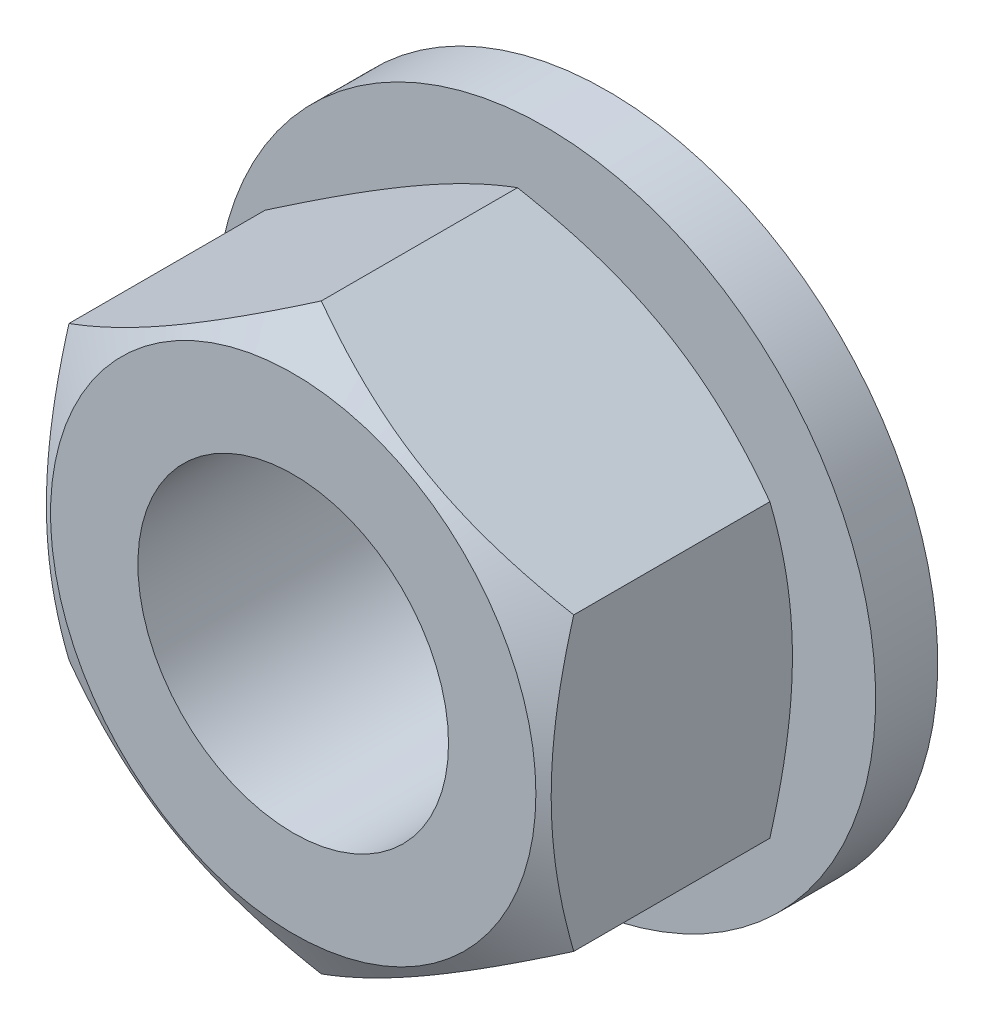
ISO-10303-21;
HEADER;
FILE_DESCRIPTION(('STEP AP214'),'2;1');
FILE_NAME('part.step','',(''),(''),'','','');
FILE_SCHEMA(('AUTOMOTIVE_DESIGN { 1 0 10303 214 1 1 1 1 }'));
ENDSEC;
DATA;
#1=APPLICATION_CONTEXT('core data for automotive mechanical design processes');
#2=APPLICATION_PROTOCOL_DEFINITION('international standard','automotive_design',2000,#1);
#3=PRODUCT_CONTEXT('',#1,'mechanical');
#4=PRODUCT('Part','Part','',(#3));
#5=PRODUCT_RELATED_PRODUCT_CATEGORY('part','',(#4));
#6=PRODUCT_DEFINITION_FORMATION('','',#4);
#7=PRODUCT_DEFINITION_CONTEXT('part definition',#1,'design');
#8=PRODUCT_DEFINITION('design','',#6,#7);
#9=PRODUCT_DEFINITION_SHAPE('','',#8);
#10=(LENGTH_UNIT() NAMED_UNIT(*) SI_UNIT(.MILLI.,.METRE.));
#11=(NAMED_UNIT(*) PLANE_ANGLE_UNIT() SI_UNIT($,.RADIAN.));
#12=(NAMED_UNIT(*) SI_UNIT($,.STERADIAN.) SOLID_ANGLE_UNIT());
#13=UNCERTAINTY_MEASURE_WITH_UNIT(LENGTH_MEASURE(1.E-05),#10,'distance_accuracy_value','');
#14=(GEOMETRIC_REPRESENTATION_CONTEXT(3) GLOBAL_UNCERTAINTY_ASSIGNED_CONTEXT((#13)) GLOBAL_UNIT_ASSIGNED_CONTEXT((#10,
#11,#12)) REPRESENTATION_CONTEXT('',''));
#15=CARTESIAN_POINT('',(0.,0.,0.));
#16=DIRECTION('',(0.,0.,1.));
#17=DIRECTION('',(1.,0.,0.));
#18=AXIS2_PLACEMENT_3D('',#15,#16,#17);
#19=CARTESIAN_POINT('',(-6.5,-3.75277674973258,8.1));
#20=DIRECTION('',(-1.,0.,0.));
#21=DIRECTION('',(0.,0.,1.));
#22=AXIS2_PLACEMENT_3D('',#19,#20,#21);
#23=PLANE('',#22);
#24=DIRECTION('',(0.,0.,-1.));
#25=VECTOR('',#24,1.);
#26=CARTESIAN_POINT('',(-6.5,-3.75277674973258,8.1));
#27=LINE('',#26,#25);
#28=CARTESIAN_POINT('',(-6.5,-3.75277674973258,7.37510584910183));
#29=VERTEX_POINT('',#28);
#30=CARTESIAN_POINT('',(-6.5,-3.75277674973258,2.32489415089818));
#31=VERTEX_POINT('',#30);
#32=EDGE_CURVE('E9',#29,#31,#27,.T.);
#33=ORIENTED_EDGE('',*,*,#32,.F.);
#34=CARTESIAN_POINT('',(-6.5,-10.0376561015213,4.80422452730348));
#35=CARTESIAN_POINT('',(-6.5,-9.75411250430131,4.94159609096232));
#36=CARTESIAN_POINT('',(-6.5,-9.46991338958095,5.077638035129));
#37=CARTESIAN_POINT('',(-6.5,-8.89985536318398,5.34631399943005));
#38=CARTESIAN_POINT('',(-6.5,-8.61399619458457,5.47894747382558));
#39=CARTESIAN_POINT('',(-6.5,-8.03877585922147,5.74073425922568));
#40=CARTESIAN_POINT('',(-6.5,-7.74940407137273,5.86986431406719));
#41=CARTESIAN_POINT('',(-6.5,-7.16834386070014,6.12278244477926));
#42=CARTESIAN_POINT('',(-6.5,-6.87665554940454,6.24657077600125));
#43=CARTESIAN_POINT('',(-6.5,-6.28125325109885,6.49119214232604));
#44=CARTESIAN_POINT('',(-6.5,-5.97744998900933,6.61180907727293));
#45=CARTESIAN_POINT('',(-6.5,-5.36627311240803,6.84381010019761));
#46=CARTESIAN_POINT('',(-6.5,-5.05889909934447,6.95519314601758));
#47=CARTESIAN_POINT('',(-6.5,-4.44068218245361,7.16577134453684));
#48=CARTESIAN_POINT('',(-6.5,-4.12984789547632,7.26499154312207));
#49=CARTESIAN_POINT('',(-6.5,-3.50371775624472,7.44803088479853));
#50=CARTESIAN_POINT('',(-6.5,-3.18842335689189,7.53185492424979));
#51=CARTESIAN_POINT('',(-6.5,-2.55494944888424,7.67961205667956));
#52=CARTESIAN_POINT('',(-6.5,-2.2367951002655,7.74365127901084));
#53=CARTESIAN_POINT('',(-6.5,-1.59653036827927,7.84817364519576));
#54=CARTESIAN_POINT('',(-6.5,-1.27442034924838,7.8886589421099));
#55=CARTESIAN_POINT('',(-6.5,-0.791708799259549,7.9290321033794));
#56=CARTESIAN_POINT('',(-6.5,-0.631917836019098,7.93909642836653));
#57=CARTESIAN_POINT('',(-6.5,-0.312046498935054,7.95246757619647));
#58=CARTESIAN_POINT('',(-6.5,-0.1519661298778,7.95577450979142));
#59=CARTESIAN_POINT('',(-6.5,0.168189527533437,7.95554451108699));
#60=CARTESIAN_POINT('',(-6.5,0.328264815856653,7.95200754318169));
#61=CARTESIAN_POINT('',(-6.5,0.648125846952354,7.93817746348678));
#62=CARTESIAN_POINT('',(-6.5,0.807911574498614,7.92788400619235));
#63=CARTESIAN_POINT('',(-6.5,1.19322981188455,7.89513066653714));
#64=CARTESIAN_POINT('',(-6.5,1.41848933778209,7.86939241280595));
#65=CARTESIAN_POINT('',(-6.5,1.86729775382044,7.80590134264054));
#66=CARTESIAN_POINT('',(-6.5,2.09084640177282,7.76814685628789));
#67=CARTESIAN_POINT('',(-6.5,2.75869205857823,7.6388642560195));
#68=CARTESIAN_POINT('',(-6.5,3.19993162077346,7.53134171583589));
#69=CARTESIAN_POINT('',(-6.5,3.85964942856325,7.3453762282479));
#70=CARTESIAN_POINT('',(-6.5,4.08156176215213,7.27841935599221));
#71=CARTESIAN_POINT('',(-6.5,4.52323021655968,7.13767302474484));
#72=CARTESIAN_POINT('',(-6.5,4.74298632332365,7.06388352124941));
#73=CARTESIAN_POINT('',(-6.5,5.18041384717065,6.91064572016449));
#74=CARTESIAN_POINT('',(-6.5,5.39808595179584,6.83119936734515));
#75=CARTESIAN_POINT('',(-6.5,5.83163487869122,6.66757047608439));
#76=CARTESIAN_POINT('',(-6.5,6.04751172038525,6.58338798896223));
#77=CARTESIAN_POINT('',(-6.5,6.55037775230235,6.38195062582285));
#78=CARTESIAN_POINT('',(-6.5,6.8367403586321,6.26313460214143));
#79=CARTESIAN_POINT('',(-6.5,7.40708826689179,6.01991162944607));
#80=CARTESIAN_POINT('',(-6.5,7.69107343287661,5.8955043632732));
#81=CARTESIAN_POINT('',(-6.5,8.25709520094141,5.64220339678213));
#82=CARTESIAN_POINT('',(-6.5,8.53913142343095,5.51330885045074));
#83=CARTESIAN_POINT('',(-6.5,9.10153191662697,5.2519160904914));
#84=CARTESIAN_POINT('',(-6.5,9.38189615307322,5.11941780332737));
#85=CARTESIAN_POINT('',(-6.5,9.94150180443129,4.85134949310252));
#86=CARTESIAN_POINT('',(-6.5,10.2207417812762,4.71577647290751));
#87=CARTESIAN_POINT('',(-6.5,10.7780317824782,4.44220418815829));
#88=CARTESIAN_POINT('',(-6.5,11.0560817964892,4.30420490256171));
#89=CARTESIAN_POINT('',(-6.5,11.8886573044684,3.88723826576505));
#90=CARTESIAN_POINT('',(-6.5,12.4416787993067,3.60526807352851));
#91=CARTESIAN_POINT('',(-6.5,13.4996337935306,3.0589862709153));
#92=CARTESIAN_POINT('',(-6.5,14.0047976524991,2.7951188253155));
#93=CARTESIAN_POINT('',(-6.5,15.0132440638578,2.2637753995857));
#94=CARTESIAN_POINT('',(-6.5,15.5165265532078,1.99629929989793));
#95=CARTESIAN_POINT('',(-6.5,16.5204177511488,1.45923474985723));
#96=CARTESIAN_POINT('',(-6.5,17.0210299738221,1.18965285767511));
#97=CARTESIAN_POINT('',(-6.5,18.0210477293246,0.648322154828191));
#98=CARTESIAN_POINT('',(-6.5,18.5204533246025,0.376573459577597));
#99=CARTESIAN_POINT('',(-6.5,19.0194129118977,0.104013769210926));
#100=B_SPLINE_CURVE_WITH_KNOTS('',3,(#34,#35,#36,#37,#38,#39,#40,#41,#42,#43,#44,#45,#46,#47,
#48,#49,#50,#51,#52,#53,#54,#55,#56,#57,#58,#59,#60,#61,#62,#63,#64,#65,#66,#67,#68,#69,#70,#71,
#72,#73,#74,#75,#76,#77,#78,#79,#80,#81,#82,#83,#84,#85,#86,#87,#88,#89,#90,#91,#92,#93,#94,#95,
#96,#97,#98,#99),.UNSPECIFIED.,.F.,.F.,(4,2,2,2,2,2,2,2,2,2,2,2,2,2,2,2,2,2,2,2,2,2,2,2,2,2,2,2,
2,2,2,2,4),(0.,0.945216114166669,1.89058263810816,2.84116840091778,3.7917086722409,
4.77220681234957,5.75281546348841,6.73136964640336,7.70961208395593,8.68251209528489,
9.65532316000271,10.1355247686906,10.615718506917,11.0959147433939,11.5761355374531,
12.2559262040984,12.9358113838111,14.296353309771,14.9916778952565,15.6870070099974,
16.3820982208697,17.0771819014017,18.0072031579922,18.9372772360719,19.867527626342,
20.7977970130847,21.7290158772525,22.6602428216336,24.5224617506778,26.2322265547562,
27.942048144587,29.647792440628,31.3534464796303),.UNSPECIFIED.);
#101=CARTESIAN_POINT('',(-6.5,3.75277674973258,7.37510584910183));
#102=VERTEX_POINT('',#101);
#103=EDGE_CURVE('E69',#29,#102,#100,.T.);
#104=ORIENTED_EDGE('',*,*,#103,.T.);
#105=DIRECTION('',(0.,0.,-1.));
#106=VECTOR('',#105,1.);
#107=CARTESIAN_POINT('',(-6.5,3.75277674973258,8.1));
#108=LINE('',#107,#106);
#109=CARTESIAN_POINT('',(-6.5,3.75277674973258,2.32489415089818));
#110=VERTEX_POINT('',#109);
#111=EDGE_CURVE('E38',#102,#110,#108,.T.);
#112=ORIENTED_EDGE('',*,*,#111,.T.);
#113=CARTESIAN_POINT('',(-6.5,-10.0118859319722,4.8832916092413));
#114=CARTESIAN_POINT('',(-6.5,-9.72855336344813,4.74612691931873));
#115=CARTESIAN_POINT('',(-6.5,-9.44456295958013,4.61029742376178));
#116=CARTESIAN_POINT('',(-6.5,-8.87491638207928,4.34206118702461));
#117=CARTESIAN_POINT('',(-6.5,-8.58925994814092,4.20965499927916));
#118=CARTESIAN_POINT('',(-6.5,-8.01442627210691,3.94833687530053));
#119=CARTESIAN_POINT('',(-6.5,-7.72523828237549,3.81944849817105));
#120=CARTESIAN_POINT('',(-6.5,-7.14453800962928,3.56703882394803));
#121=CARTESIAN_POINT('',(-6.5,-6.85302583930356,3.44351726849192));
#122=CARTESIAN_POINT('',(-6.5,-6.25807741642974,3.19951345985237));
#123=CARTESIAN_POINT('',(-6.5,-5.95455264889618,3.07924583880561));
#124=CARTESIAN_POINT('',(-6.5,-5.34392655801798,2.84798011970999));
#125=CARTESIAN_POINT('',(-6.5,-5.03682483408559,2.73698307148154));
#126=CARTESIAN_POINT('',(-6.5,-4.41915477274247,2.52722237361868));
#127=CARTESIAN_POINT('',(-6.5,-4.10859513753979,2.42843335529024));
#128=CARTESIAN_POINT('',(-6.5,-3.48301880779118,2.24630497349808));
#129=CARTESIAN_POINT('',(-6.5,-3.16800357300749,2.16296067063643));
#130=CARTESIAN_POINT('',(-6.5,-2.53508513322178,2.0162010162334));
#131=CARTESIAN_POINT('',(-6.5,-2.21720674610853,1.9526803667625));
#132=CARTESIAN_POINT('',(-6.5,-1.577525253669,1.84922188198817));
#133=CARTESIAN_POINT('',(-6.5,-1.2557225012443,1.80928194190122));
#134=CARTESIAN_POINT('',(-6.5,-0.773490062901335,1.76971130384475));
#135=CARTESIAN_POINT('',(-6.5,-0.613854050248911,1.75991023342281));
#136=CARTESIAN_POINT('',(-6.5,-0.294303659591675,1.74705683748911));
#137=CARTESIAN_POINT('',(-6.5,-0.134389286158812,1.74400440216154));
#138=CARTESIAN_POINT('',(-6.5,0.18542391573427,1.7447285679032));
#139=CARTESIAN_POINT('',(-6.5,0.345322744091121,1.7485052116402));
#140=CARTESIAN_POINT('',(-6.5,0.664821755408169,1.76279442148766));
#141=CARTESIAN_POINT('',(-6.5,0.824421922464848,1.77330733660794));
#142=CARTESIAN_POINT('',(-6.5,1.21009106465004,1.80663121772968));
#143=CARTESIAN_POINT('',(-6.5,1.43587954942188,1.8327551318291));
#144=CARTESIAN_POINT('',(-6.5,1.88572477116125,1.89704439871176));
#145=CARTESIAN_POINT('',(-6.5,2.10978125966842,1.93521144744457));
#146=CARTESIAN_POINT('',(-6.5,2.77912789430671,2.06574869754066));
#147=CARTESIAN_POINT('',(-6.5,3.22133379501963,2.17412948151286));
#148=CARTESIAN_POINT('',(-6.5,3.88246330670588,2.36136414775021));
#149=CARTESIAN_POINT('',(-6.5,4.10483365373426,2.42874144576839));
#150=CARTESIAN_POINT('',(-6.5,4.54741339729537,2.5703175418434));
#151=CARTESIAN_POINT('',(-6.5,4.76762277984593,2.64451638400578));
#152=CARTESIAN_POINT('',(-6.5,5.20595333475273,2.79855980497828));
#153=CARTESIAN_POINT('',(-6.5,5.42407520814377,2.87840240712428));
#154=CARTESIAN_POINT('',(-6.5,5.85852369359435,3.0428115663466));
#155=CARTESIAN_POINT('',(-6.5,6.07485032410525,3.1273780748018));
#156=CARTESIAN_POINT('',(-6.5,6.57455675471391,3.3280091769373));
#157=CARTESIAN_POINT('',(-6.5,6.85735139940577,3.44552826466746));
#158=CARTESIAN_POINT('',(-6.5,7.42062861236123,3.68599704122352));
#159=CARTESIAN_POINT('',(-6.5,7.70111105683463,3.80894701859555));
#160=CARTESIAN_POINT('',(-6.5,8.26017575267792,4.05921670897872));
#161=CARTESIAN_POINT('',(-6.5,8.53875764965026,4.18653721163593));
#162=CARTESIAN_POINT('',(-6.5,9.09428863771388,4.44469787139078));
#163=CARTESIAN_POINT('',(-6.5,9.3712376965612,4.57553809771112));
#164=CARTESIAN_POINT('',(-6.5,9.92401115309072,4.84021331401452));
#165=CARTESIAN_POINT('',(-6.5,10.1998342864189,4.97405094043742));
#166=CARTESIAN_POINT('',(-6.5,10.750313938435,5.24410623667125));
#167=CARTESIAN_POINT('',(-6.5,11.0249704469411,5.38032392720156));
#168=CARTESIAN_POINT('',(-6.5,11.8474745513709,5.79193510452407));
#169=CARTESIAN_POINT('',(-6.5,12.3938452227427,6.07028114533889));
#170=CARTESIAN_POINT('',(-6.5,13.189271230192,6.48066012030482));
#171=CARTESIAN_POINT('',(-6.5,13.4394696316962,6.61049135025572));
#172=CARTESIAN_POINT('',(-6.5,13.9393233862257,6.87118553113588));
#173=CARTESIAN_POINT('',(-6.5,14.1889787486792,7.00204846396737));
#174=CARTESIAN_POINT('',(-6.5,14.9372586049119,7.39598704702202));
#175=CARTESIAN_POINT('',(-6.5,15.4351776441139,7.6604025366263));
#176=CARTESIAN_POINT('',(-6.5,16.4283993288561,8.19135046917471));
#177=CARTESIAN_POINT('',(-6.5,16.9237053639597,8.45787658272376));
#178=CARTESIAN_POINT('',(-6.5,17.9131191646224,8.9930841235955));
#179=CARTESIAN_POINT('',(-6.5,18.4072269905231,9.26176543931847));
#180=CARTESIAN_POINT('',(-6.5,18.9008904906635,9.53125551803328));
#181=B_SPLINE_CURVE_WITH_KNOTS('',3,(#113,#114,#115,#116,#117,#118,#119,#120,#121,#122,#123,
#124,#125,#126,#127,#128,#129,#130,#131,#132,#133,#134,#135,#136,#137,#138,#139,#140,#141,#142,
#143,#144,#145,#146,#147,#148,#149,#150,#151,#152,#153,#154,#155,#156,#157,#158,#159,#160,#161,
#162,#163,#164,#165,#166,#167,#168,#169,#170,#171,#172,#173,#174,#175,#176,#177,#178,#179,#180),
.UNSPECIFIED.,.F.,.F.,(4,2,2,2,2,2,2,2,2,2,2,2,2,2,2,2,2,2,2,2,2,2,2,2,2,2,2,2,2,2,2,2,2,4),(0.,
0.944375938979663,1.88890360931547,2.83869006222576,3.78843074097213,4.76776487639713,
5.74720976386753,6.72458382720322,7.7016447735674,8.67342384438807,9.64511616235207,
10.1248049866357,10.6044860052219,11.0841700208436,11.5638788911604,12.2453767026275,
12.9269705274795,14.2909426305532,14.9879481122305,15.6849581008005,16.3817251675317,
17.0784850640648,17.9971327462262,18.9158292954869,19.8346927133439,20.753574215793,
21.6732984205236,22.5930306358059,24.4325333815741,25.2781675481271,26.1237869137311,
27.8150905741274,29.5024730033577,31.1897686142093),.UNSPECIFIED.);
#182=EDGE_CURVE('E89',#31,#110,#181,.T.);
#183=ORIENTED_EDGE('',*,*,#182,.F.);
#184=EDGE_LOOP('',(#33,#104,#112,#183));
#185=FACE_BOUND('',#184,.T.);
#186=ADVANCED_FACE('F14',(#185),#23,.T.);
#187=CARTESIAN_POINT('',(-6.5,-3.75277674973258,8.1));
#188=DIRECTION('',(0.5,0.866025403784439,0.));
#189=DIRECTION('',(-0.866025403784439,0.5,0.));
#190=AXIS2_PLACEMENT_3D('',#187,#188,#189);
#191=PLANE('',#190);
#192=CARTESIAN_POINT('',(-6.5002,-3.75266127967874,7.37503918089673));
#193=CARTESIAN_POINT('',(-6.35732254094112,-3.83515161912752,7.42265800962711));
#194=CARTESIAN_POINT('',(-6.21391236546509,-3.91794952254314,7.46811573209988));
#195=CARTESIAN_POINT('',(-5.9259273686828,-4.08421773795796,7.55411375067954));
#196=CARTESIAN_POINT('',(-5.78135207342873,-4.16768832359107,7.59465192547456));
#197=CARTESIAN_POINT('',(-5.34531134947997,-4.41943655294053,7.70809143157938));
#198=CARTESIAN_POINT('',(-5.05212471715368,-4.58870793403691,7.77261462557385));
#199=CARTESIAN_POINT('',(-4.61337625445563,-4.84201947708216,7.8482758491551));
#200=CARTESIAN_POINT('',(-4.46912536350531,-4.92530276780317,7.8698295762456));
#201=CARTESIAN_POINT('',(-4.17997178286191,-5.09224566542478,7.90597211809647));
#202=CARTESIAN_POINT('',(-4.03506915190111,-5.17590523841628,7.92056154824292));
#203=CARTESIAN_POINT('',(-3.74501222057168,-5.34336968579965,7.94240368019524));
#204=CARTESIAN_POINT('',(-3.59985839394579,-5.42717428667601,7.94966470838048));
#205=CARTESIAN_POINT('',(-3.30942466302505,-5.59485627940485,7.95670213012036));
#206=CARTESIAN_POINT('',(-3.16414476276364,-5.67873366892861,7.95647875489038));
#207=CARTESIAN_POINT('',(-2.76612405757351,-5.90853103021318,7.94557897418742));
#208=CARTESIAN_POINT('',(-2.51351353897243,-6.05437578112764,7.92728061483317));
#209=CARTESIAN_POINT('',(-2.00997032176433,-6.34509659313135,7.86925609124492));
#210=CARTESIAN_POINT('',(-1.75903939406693,-6.48997163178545,7.82951009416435));
#211=CARTESIAN_POINT('',(-1.25448277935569,-6.78127752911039,7.73015652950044));
#212=CARTESIAN_POINT('',(-1.0009207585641,-6.92767163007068,7.67012800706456));
#213=CARTESIAN_POINT('',(-0.497578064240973,-7.21827667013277,7.53388744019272));
#214=CARTESIAN_POINT('',(-0.247790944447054,-7.36249133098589,7.457707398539));
#215=CARTESIAN_POINT('',(0.000199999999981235,-7.50566896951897,7.37503918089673));
#216=B_SPLINE_CURVE_WITH_KNOTS('',3,(#192,#193,#194,#195,#196,#197,#198,#199,#200,#201,#202,
#203,#204,#205,#206,#207,#208,#209,#210,#211,#212,#213,#214,#215),.UNSPECIFIED.,.F.,.F.,(4,2,2,
2,2,2,2,2,2,2,2,4),(0.,0.515105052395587,1.03043143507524,2.06322554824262,2.56697389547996,
3.07067772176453,3.57380860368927,4.07692394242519,4.95279354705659,5.82947446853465,
6.72559912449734,7.61996451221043),.UNSPECIFIED.);
#217=CARTESIAN_POINT('',(0.,-7.50555349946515,7.37510584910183));
#218=VERTEX_POINT('',#217);
#219=EDGE_CURVE('E77',#29,#218,#216,.T.);
#220=ORIENTED_EDGE('',*,*,#219,.F.);
#221=ORIENTED_EDGE('',*,*,#32,.T.);
#222=CARTESIAN_POINT('',(-6.5002,-3.75266127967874,2.32496081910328));
#223=CARTESIAN_POINT('',(-6.35732254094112,-3.83515161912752,2.2773419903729));
#224=CARTESIAN_POINT('',(-6.21391236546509,-3.91794952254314,2.23188426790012));
#225=CARTESIAN_POINT('',(-5.9259273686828,-4.08421773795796,2.14588624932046));
#226=CARTESIAN_POINT('',(-5.78135207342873,-4.16768832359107,2.10534807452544));
#227=CARTESIAN_POINT('',(-5.34531134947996,-4.41943655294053,1.99190856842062));
#228=CARTESIAN_POINT('',(-5.05212471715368,-4.58870793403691,1.92738537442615));
#229=CARTESIAN_POINT('',(-4.61337625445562,-4.84201947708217,1.8517241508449));
#230=CARTESIAN_POINT('',(-4.4691253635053,-4.92530276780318,1.8301704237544));
#231=CARTESIAN_POINT('',(-4.1799717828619,-5.09224566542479,1.79402788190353));
#232=CARTESIAN_POINT('',(-4.0350691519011,-5.17590523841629,1.77943845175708));
#233=CARTESIAN_POINT('',(-3.74501222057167,-5.34336968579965,1.75759631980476));
#234=CARTESIAN_POINT('',(-3.59985839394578,-5.42717428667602,1.75033529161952));
#235=CARTESIAN_POINT('',(-3.30942466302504,-5.59485627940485,1.74329786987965));
#236=CARTESIAN_POINT('',(-3.16414476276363,-5.67873366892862,1.74352124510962));
#237=CARTESIAN_POINT('',(-2.7661240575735,-5.90853103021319,1.75442102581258));
#238=CARTESIAN_POINT('',(-2.51351353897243,-6.05437578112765,1.77271938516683));
#239=CARTESIAN_POINT('',(-2.00997032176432,-6.34509659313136,1.83074390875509));
#240=CARTESIAN_POINT('',(-1.75903939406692,-6.48997163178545,1.87048990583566));
#241=CARTESIAN_POINT('',(-1.25448277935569,-6.78127752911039,1.96984347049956));
#242=CARTESIAN_POINT('',(-1.0009207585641,-6.92767163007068,2.02987199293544));
#243=CARTESIAN_POINT('',(-0.497578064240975,-7.21827667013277,2.16611255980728));
#244=CARTESIAN_POINT('',(-0.247790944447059,-7.36249133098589,2.242292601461));
#245=CARTESIAN_POINT('',(0.000199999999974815,-7.50566896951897,2.32496081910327));
#246=B_SPLINE_CURVE_WITH_KNOTS('',3,(#222,#223,#224,#225,#226,#227,#228,#229,#230,#231,#232,
#233,#234,#235,#236,#237,#238,#239,#240,#241,#242,#243,#244,#245),.UNSPECIFIED.,.F.,.F.,(4,2,2,
2,2,2,2,2,2,2,2,4),(0.,0.515105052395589,1.03043143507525,2.06322554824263,2.56697389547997,
3.07067772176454,3.57380860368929,4.07692394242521,4.9527935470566,5.82947446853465,
6.72559912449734,7.61996451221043),.UNSPECIFIED.);
#247=CARTESIAN_POINT('',(0.,-7.50555349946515,2.32489415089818));
#248=VERTEX_POINT('',#247);
#249=EDGE_CURVE('E111',#31,#248,#246,.T.);
#250=ORIENTED_EDGE('',*,*,#249,.T.);
#251=DIRECTION('',(0.,0.,-1.));
#252=VECTOR('',#251,1.);
#253=CARTESIAN_POINT('',(0.,-7.50555349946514,8.1));
#254=LINE('',#253,#252);
#255=EDGE_CURVE('E23',#218,#248,#254,.T.);
#256=ORIENTED_EDGE('',*,*,#255,.F.);
#257=EDGE_LOOP('',(#220,#221,#250,#256));
#258=FACE_BOUND('',#257,.T.);
#259=ADVANCED_FACE('F16',(#258),#191,.F.);
#260=CARTESIAN_POINT('',(6.5,-3.75277674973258,8.1));
#261=DIRECTION('',(0.5,-0.86602540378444,0.));
#262=DIRECTION('',(0.86602540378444,0.5,0.));
#263=AXIS2_PLACEMENT_3D('',#260,#261,#262);
#264=PLANE('',#263);
#265=DIRECTION('',(0.,0.,-1.));
#266=VECTOR('',#265,1.);
#267=CARTESIAN_POINT('',(6.5,-3.75277674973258,8.1));
#268=LINE('',#267,#266);
#269=CARTESIAN_POINT('',(6.5,-3.75277674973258,7.37510584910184));
#270=VERTEX_POINT('',#269);
#271=CARTESIAN_POINT('',(6.5,-3.75277674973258,2.32489415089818));
#272=VERTEX_POINT('',#271);
#273=EDGE_CURVE('E94',#270,#272,#268,.T.);
#274=ORIENTED_EDGE('',*,*,#273,.F.);
#275=CARTESIAN_POINT('',(6.5002,-3.75266127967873,7.37503918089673));
#276=CARTESIAN_POINT('',(6.35732254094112,-3.83515161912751,7.42265800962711));
#277=CARTESIAN_POINT('',(6.21391236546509,-3.91794952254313,7.46811573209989));
#278=CARTESIAN_POINT('',(5.9259273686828,-4.08421773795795,7.55411375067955));
#279=CARTESIAN_POINT('',(5.78135207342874,-4.16768832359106,7.59465192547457));
#280=CARTESIAN_POINT('',(5.34531134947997,-4.41943655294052,7.70809143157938));
#281=CARTESIAN_POINT('',(5.05212471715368,-4.5887079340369,7.77261462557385));
#282=CARTESIAN_POINT('',(4.61337625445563,-4.84201947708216,7.8482758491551));
#283=CARTESIAN_POINT('',(4.46912536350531,-4.92530276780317,7.86982957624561));
#284=CARTESIAN_POINT('',(4.17997178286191,-5.09224566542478,7.90597211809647));
#285=CARTESIAN_POINT('',(4.03506915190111,-5.17590523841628,7.92056154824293));
#286=CARTESIAN_POINT('',(3.74501222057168,-5.34336968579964,7.94240368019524));
#287=CARTESIAN_POINT('',(3.59985839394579,-5.427174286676,7.94966470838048));
#288=CARTESIAN_POINT('',(3.30942466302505,-5.59485627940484,7.95670213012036));
#289=CARTESIAN_POINT('',(3.16414476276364,-5.67873366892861,7.95647875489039));
#290=CARTESIAN_POINT('',(2.76612405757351,-5.90853103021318,7.94557897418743));
#291=CARTESIAN_POINT('',(2.51351353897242,-6.05437578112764,7.92728061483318));
#292=CARTESIAN_POINT('',(2.00997032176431,-6.34509659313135,7.86925609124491));
#293=CARTESIAN_POINT('',(1.75903939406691,-6.48997163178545,7.82951009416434));
#294=CARTESIAN_POINT('',(1.25448277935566,-6.7812775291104,7.73015652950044));
#295=CARTESIAN_POINT('',(1.00092075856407,-6.92767163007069,7.67012800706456));
#296=CARTESIAN_POINT('',(0.497578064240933,-7.21827667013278,7.53388744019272));
#297=CARTESIAN_POINT('',(0.247790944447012,-7.3624913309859,7.45770739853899));
#298=CARTESIAN_POINT('',(-0.000200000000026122,-7.50566896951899,7.37503918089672));
#299=B_SPLINE_CURVE_WITH_KNOTS('',3,(#275,#276,#277,#278,#279,#280,#281,#282,#283,#284,#285,
#286,#287,#288,#289,#290,#291,#292,#293,#294,#295,#296,#297,#298),.UNSPECIFIED.,.F.,.F.,(4,2,2,
2,2,2,2,2,2,2,2,4),(0.,0.515105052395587,1.03043143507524,2.06322554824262,2.56697389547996,
3.07067772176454,3.57380860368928,4.0769239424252,4.95279354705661,5.82947446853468,
6.72559912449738,7.61996451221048),.UNSPECIFIED.);
#300=EDGE_CURVE('E103',#270,#218,#299,.T.);
#301=ORIENTED_EDGE('',*,*,#300,.T.);
#302=ORIENTED_EDGE('',*,*,#255,.T.);
#303=CARTESIAN_POINT('',(6.5002,-3.75266127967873,2.32496081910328));
#304=CARTESIAN_POINT('',(6.35732254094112,-3.83515161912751,2.2773419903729));
#305=CARTESIAN_POINT('',(6.21391236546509,-3.91794952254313,2.23188426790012));
#306=CARTESIAN_POINT('',(5.9259273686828,-4.08421773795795,2.14588624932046));
#307=CARTESIAN_POINT('',(5.78135207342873,-4.16768832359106,2.10534807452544));
#308=CARTESIAN_POINT('',(5.34531134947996,-4.41943655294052,1.99190856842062));
#309=CARTESIAN_POINT('',(5.05212471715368,-4.5887079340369,1.92738537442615));
#310=CARTESIAN_POINT('',(4.61337625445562,-4.84201947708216,1.8517241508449));
#311=CARTESIAN_POINT('',(4.4691253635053,-4.92530276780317,1.8301704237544));
#312=CARTESIAN_POINT('',(4.17997178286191,-5.09224566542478,1.79402788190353));
#313=CARTESIAN_POINT('',(4.0350691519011,-5.17590523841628,1.77943845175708));
#314=CARTESIAN_POINT('',(3.74501222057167,-5.34336968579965,1.75759631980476));
#315=CARTESIAN_POINT('',(3.59985839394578,-5.42717428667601,1.75033529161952));
#316=CARTESIAN_POINT('',(3.30942466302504,-5.59485627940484,1.74329786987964));
#317=CARTESIAN_POINT('',(3.16414476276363,-5.67873366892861,1.74352124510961));
#318=CARTESIAN_POINT('',(2.7661240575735,-5.90853103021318,1.75442102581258));
#319=CARTESIAN_POINT('',(2.51351353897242,-6.05437578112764,1.77271938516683));
#320=CARTESIAN_POINT('',(2.00997032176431,-6.34509659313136,1.83074390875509));
#321=CARTESIAN_POINT('',(1.7590393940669,-6.48997163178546,1.87048990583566));
#322=CARTESIAN_POINT('',(1.25448277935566,-6.7812775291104,1.96984347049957));
#323=CARTESIAN_POINT('',(1.00092075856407,-6.92767163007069,2.02987199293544));
#324=CARTESIAN_POINT('',(0.497578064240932,-7.21827667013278,2.16611255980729));
#325=CARTESIAN_POINT('',(0.247790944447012,-7.3624913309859,2.24229260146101));
#326=CARTESIAN_POINT('',(-0.000200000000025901,-7.50566896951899,2.32496081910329));
#327=B_SPLINE_CURVE_WITH_KNOTS('',3,(#303,#304,#305,#306,#307,#308,#309,#310,#311,#312,#313,
#314,#315,#316,#317,#318,#319,#320,#321,#322,#323,#324,#325,#326),.UNSPECIFIED.,.F.,.F.,(4,2,2,
2,2,2,2,2,2,2,2,4),(0.,0.515105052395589,1.03043143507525,2.06322554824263,2.56697389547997,
3.07067772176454,3.57380860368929,4.07692394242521,4.95279354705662,5.82947446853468,
6.72559912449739,7.61996451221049),.UNSPECIFIED.);
#328=EDGE_CURVE('E102',#272,#248,#327,.T.);
#329=ORIENTED_EDGE('',*,*,#328,.F.);
#330=EDGE_LOOP('',(#274,#301,#302,#329));
#331=FACE_BOUND('',#330,.T.);
#332=ADVANCED_FACE('F101',(#331),#264,.T.);
#333=CARTESIAN_POINT('',(6.5,-3.75277674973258,8.1));
#334=DIRECTION('',(-1.,0.,0.));
#335=DIRECTION('',(0.,0.,1.));
#336=AXIS2_PLACEMENT_3D('',#333,#334,#335);
#337=PLANE('',#336);
#338=CARTESIAN_POINT('',(6.5,-10.0376561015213,4.80422452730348));
#339=CARTESIAN_POINT('',(6.5,-9.75411250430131,4.94159609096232));
#340=CARTESIAN_POINT('',(6.5,-9.46991338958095,5.077638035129));
#341=CARTESIAN_POINT('',(6.5,-8.89985536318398,5.34631399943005));
#342=CARTESIAN_POINT('',(6.5,-8.61399619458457,5.47894747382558));
#343=CARTESIAN_POINT('',(6.5,-8.03877585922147,5.74073425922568));
#344=CARTESIAN_POINT('',(6.5,-7.74940407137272,5.8698643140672));
#345=CARTESIAN_POINT('',(6.5,-7.16834386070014,6.12278244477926));
#346=CARTESIAN_POINT('',(6.5,-6.87665554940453,6.24657077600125));
#347=CARTESIAN_POINT('',(6.5,-6.28125325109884,6.49119214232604));
#348=CARTESIAN_POINT('',(6.5,-5.97744998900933,6.61180907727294));
#349=CARTESIAN_POINT('',(6.5,-5.36627311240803,6.84381010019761));
#350=CARTESIAN_POINT('',(6.5,-5.05889909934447,6.95519314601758));
#351=CARTESIAN_POINT('',(6.5,-4.44068218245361,7.16577134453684));
#352=CARTESIAN_POINT('',(6.5,-4.12984789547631,7.26499154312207));
#353=CARTESIAN_POINT('',(6.5,-3.50371775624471,7.44803088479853));
#354=CARTESIAN_POINT('',(6.5,-3.18842335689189,7.53185492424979));
#355=CARTESIAN_POINT('',(6.5,-2.55494944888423,7.67961205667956));
#356=CARTESIAN_POINT('',(6.5,-2.23679510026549,7.74365127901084));
#357=CARTESIAN_POINT('',(6.5,-1.59653036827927,7.84817364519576));
#358=CARTESIAN_POINT('',(6.5,-1.27442034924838,7.8886589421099));
#359=CARTESIAN_POINT('',(6.5,-0.791708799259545,7.9290321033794));
#360=CARTESIAN_POINT('',(6.5,-0.631917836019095,7.93909642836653));
#361=CARTESIAN_POINT('',(6.5,-0.312046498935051,7.95246757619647));
#362=CARTESIAN_POINT('',(6.5,-0.151966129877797,7.95577450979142));
#363=CARTESIAN_POINT('',(6.5,0.168189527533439,7.95554451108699));
#364=CARTESIAN_POINT('',(6.5,0.328264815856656,7.95200754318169));
#365=CARTESIAN_POINT('',(6.5,0.648125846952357,7.93817746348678));
#366=CARTESIAN_POINT('',(6.5,0.807911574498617,7.92788400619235));
#367=CARTESIAN_POINT('',(6.5,1.19322981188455,7.89513066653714));
#368=CARTESIAN_POINT('',(6.5,1.4184893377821,7.86939241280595));
#369=CARTESIAN_POINT('',(6.5,1.86729775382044,7.80590134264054));
#370=CARTESIAN_POINT('',(6.5,2.09084640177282,7.76814685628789));
#371=CARTESIAN_POINT('',(6.5,2.75869205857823,7.6388642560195));
#372=CARTESIAN_POINT('',(6.5,3.19993162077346,7.53134171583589));
#373=CARTESIAN_POINT('',(6.5,3.85964942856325,7.3453762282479));
#374=CARTESIAN_POINT('',(6.5,4.08156176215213,7.27841935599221));
#375=CARTESIAN_POINT('',(6.5,4.52323021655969,7.13767302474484));
#376=CARTESIAN_POINT('',(6.5,4.74298632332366,7.0638835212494));
#377=CARTESIAN_POINT('',(6.5,5.18041384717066,6.91064572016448));
#378=CARTESIAN_POINT('',(6.5,5.39808595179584,6.83119936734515));
#379=CARTESIAN_POINT('',(6.5,5.83163487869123,6.66757047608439));
#380=CARTESIAN_POINT('',(6.5,6.04751172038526,6.58338798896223));
#381=CARTESIAN_POINT('',(6.5,6.55037775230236,6.38195062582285));
#382=CARTESIAN_POINT('',(6.5,6.8367403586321,6.26313460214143));
#383=CARTESIAN_POINT('',(6.5,7.40708826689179,6.01991162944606));
#384=CARTESIAN_POINT('',(6.5,7.69107343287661,5.89550436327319));
#385=CARTESIAN_POINT('',(6.5,8.25709520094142,5.64220339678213));
#386=CARTESIAN_POINT('',(6.5,8.53913142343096,5.51330885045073));
#387=CARTESIAN_POINT('',(6.5,9.10153191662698,5.25191609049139));
#388=CARTESIAN_POINT('',(6.5,9.38189615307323,5.11941780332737));
#389=CARTESIAN_POINT('',(6.5,9.9415018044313,4.85134949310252));
#390=CARTESIAN_POINT('',(6.5,10.2207417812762,4.71577647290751));
#391=CARTESIAN_POINT('',(6.5,10.7780317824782,4.44220418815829));
#392=CARTESIAN_POINT('',(6.5,11.0560817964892,4.3042049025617));
#393=CARTESIAN_POINT('',(6.5,11.8886573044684,3.88723826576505));
#394=CARTESIAN_POINT('',(6.5,12.4416787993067,3.60526807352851));
#395=CARTESIAN_POINT('',(6.5,13.4996337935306,3.0589862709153));
#396=CARTESIAN_POINT('',(6.5,14.0047976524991,2.7951188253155));
#397=CARTESIAN_POINT('',(6.5,15.0132440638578,2.2637753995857));
#398=CARTESIAN_POINT('',(6.5,15.5165265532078,1.99629929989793));
#399=CARTESIAN_POINT('',(6.5,16.5204177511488,1.45923474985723));
#400=CARTESIAN_POINT('',(6.5,17.0210299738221,1.18965285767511));
#401=CARTESIAN_POINT('',(6.5,18.0210477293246,0.64832215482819));
#402=CARTESIAN_POINT('',(6.5,18.5204533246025,0.376573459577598));
#403=CARTESIAN_POINT('',(6.5,19.0194129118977,0.104013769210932));
#404=B_SPLINE_CURVE_WITH_KNOTS('',3,(#338,#339,#340,#341,#342,#343,#344,#345,#346,#347,#348,
#349,#350,#351,#352,#353,#354,#355,#356,#357,#358,#359,#360,#361,#362,#363,#364,#365,#366,#367,
#368,#369,#370,#371,#372,#373,#374,#375,#376,#377,#378,#379,#380,#381,#382,#383,#384,#385,#386,
#387,#388,#389,#390,#391,#392,#393,#394,#395,#396,#397,#398,#399,#400,#401,#402,#403),
.UNSPECIFIED.,.F.,.F.,(4,2,2,2,2,2,2,2,2,2,2,2,2,2,2,2,2,2,2,2,2,2,2,2,2,2,2,2,2,2,2,2,4),(0.,
0.945216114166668,1.89058263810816,2.84116840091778,3.7917086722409,4.77220681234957,
5.75281546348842,6.73136964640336,7.70961208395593,8.68251209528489,9.65532316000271,
10.1355247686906,10.615718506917,11.0959147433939,11.5761355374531,12.2559262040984,
12.9358113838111,14.296353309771,14.9916778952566,15.6870070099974,16.3820982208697,
17.0771819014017,18.0072031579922,18.9372772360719,19.867527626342,20.7977970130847,
21.7290158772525,22.6602428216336,24.5224617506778,26.2322265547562,27.942048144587,
29.647792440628,31.3534464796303),.UNSPECIFIED.);
#405=CARTESIAN_POINT('',(6.5,3.75277674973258,7.37510584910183));
#406=VERTEX_POINT('',#405);
#407=EDGE_CURVE('E173',#270,#406,#404,.T.);
#408=ORIENTED_EDGE('',*,*,#407,.F.);
#409=ORIENTED_EDGE('',*,*,#273,.T.);
#410=CARTESIAN_POINT('',(6.5,-10.0118859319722,4.88329160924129));
#411=CARTESIAN_POINT('',(6.5,-9.72855336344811,4.74612691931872));
#412=CARTESIAN_POINT('',(6.5,-9.44456295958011,4.61029742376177));
#413=CARTESIAN_POINT('',(6.5,-8.87491638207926,4.3420611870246));
#414=CARTESIAN_POINT('',(6.5,-8.5892599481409,4.20965499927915));
#415=CARTESIAN_POINT('',(6.5,-8.01442627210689,3.94833687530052));
#416=CARTESIAN_POINT('',(6.5,-7.72523828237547,3.81944849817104));
#417=CARTESIAN_POINT('',(6.5,-7.14453800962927,3.56703882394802));
#418=CARTESIAN_POINT('',(6.5,-6.85302583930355,3.44351726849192));
#419=CARTESIAN_POINT('',(6.5,-6.25807741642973,3.19951345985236));
#420=CARTESIAN_POINT('',(6.5,-5.95455264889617,3.07924583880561));
#421=CARTESIAN_POINT('',(6.5,-5.34392655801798,2.84798011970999));
#422=CARTESIAN_POINT('',(6.5,-5.03682483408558,2.73698307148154));
#423=CARTESIAN_POINT('',(6.5,-4.41915477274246,2.52722237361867));
#424=CARTESIAN_POINT('',(6.5,-4.10859513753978,2.42843335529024));
#425=CARTESIAN_POINT('',(6.5,-3.48301880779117,2.24630497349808));
#426=CARTESIAN_POINT('',(6.5,-3.16800357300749,2.16296067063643));
#427=CARTESIAN_POINT('',(6.5,-2.53508513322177,2.0162010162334));
#428=CARTESIAN_POINT('',(6.5,-2.21720674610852,1.9526803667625));
#429=CARTESIAN_POINT('',(6.5,-1.577525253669,1.84922188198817));
#430=CARTESIAN_POINT('',(6.5,-1.25572250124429,1.80928194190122));
#431=CARTESIAN_POINT('',(6.5,-0.773490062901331,1.76971130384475));
#432=CARTESIAN_POINT('',(6.5,-0.613854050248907,1.75991023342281));
#433=CARTESIAN_POINT('',(6.5,-0.294303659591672,1.74705683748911));
#434=CARTESIAN_POINT('',(6.5,-0.134389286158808,1.74400440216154));
#435=CARTESIAN_POINT('',(6.5,0.185423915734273,1.7447285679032));
#436=CARTESIAN_POINT('',(6.5,0.345322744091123,1.7485052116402));
#437=CARTESIAN_POINT('',(6.5,0.664821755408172,1.76279442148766));
#438=CARTESIAN_POINT('',(6.5,0.82442192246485,1.77330733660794));
#439=CARTESIAN_POINT('',(6.5,1.21009106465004,1.80663121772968));
#440=CARTESIAN_POINT('',(6.5,1.43587954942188,1.8327551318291));
#441=CARTESIAN_POINT('',(6.5,1.88572477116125,1.89704439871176));
#442=CARTESIAN_POINT('',(6.5,2.10978125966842,1.93521144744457));
#443=CARTESIAN_POINT('',(6.5,2.77912789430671,2.06574869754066));
#444=CARTESIAN_POINT('',(6.5,3.22133379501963,2.17412948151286));
#445=CARTESIAN_POINT('',(6.5,3.88246330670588,2.36136414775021));
#446=CARTESIAN_POINT('',(6.5,4.10483365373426,2.42874144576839));
#447=CARTESIAN_POINT('',(6.5,4.54741339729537,2.5703175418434));
#448=CARTESIAN_POINT('',(6.5,4.76762277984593,2.64451638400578));
#449=CARTESIAN_POINT('',(6.5,5.20595333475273,2.79855980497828));
#450=CARTESIAN_POINT('',(6.5,5.42407520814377,2.87840240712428));
#451=CARTESIAN_POINT('',(6.5,5.85852369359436,3.0428115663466));
#452=CARTESIAN_POINT('',(6.5,6.07485032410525,3.1273780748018));
#453=CARTESIAN_POINT('',(6.5,6.57455675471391,3.3280091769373));
#454=CARTESIAN_POINT('',(6.5,6.85735139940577,3.44552826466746));
#455=CARTESIAN_POINT('',(6.5,7.42062861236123,3.68599704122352));
#456=CARTESIAN_POINT('',(6.5,7.70111105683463,3.80894701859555));
#457=CARTESIAN_POINT('',(6.5,8.26017575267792,4.05921670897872));
#458=CARTESIAN_POINT('',(6.5,8.53875764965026,4.18653721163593));
#459=CARTESIAN_POINT('',(6.5,9.09428863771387,4.44469787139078));
#460=CARTESIAN_POINT('',(6.5,9.3712376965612,4.57553809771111));
#461=CARTESIAN_POINT('',(6.5,9.92401115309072,4.84021331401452));
#462=CARTESIAN_POINT('',(6.5,10.1998342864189,4.97405094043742));
#463=CARTESIAN_POINT('',(6.5,10.750313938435,5.24410623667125));
#464=CARTESIAN_POINT('',(6.5,11.0249704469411,5.38032392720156));
#465=CARTESIAN_POINT('',(6.5,11.8474745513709,5.79193510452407));
#466=CARTESIAN_POINT('',(6.5,12.3938452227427,6.07028114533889));
#467=CARTESIAN_POINT('',(6.5,13.189271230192,6.48066012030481));
#468=CARTESIAN_POINT('',(6.5,13.4394696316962,6.61049135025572));
#469=CARTESIAN_POINT('',(6.5,13.9393233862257,6.87118553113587));
#470=CARTESIAN_POINT('',(6.5,14.1889787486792,7.00204846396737));
#471=CARTESIAN_POINT('',(6.5,14.9372586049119,7.39598704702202));
#472=CARTESIAN_POINT('',(6.5,15.4351776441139,7.66040253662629));
#473=CARTESIAN_POINT('',(6.5,16.4283993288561,8.1913504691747));
#474=CARTESIAN_POINT('',(6.5,16.9237053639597,8.45787658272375));
#475=CARTESIAN_POINT('',(6.5,17.9131191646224,8.99308412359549));
#476=CARTESIAN_POINT('',(6.5,18.4072269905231,9.26176543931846));
#477=CARTESIAN_POINT('',(6.5,18.9008904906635,9.53125551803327));
#478=B_SPLINE_CURVE_WITH_KNOTS('',3,(#410,#411,#412,#413,#414,#415,#416,#417,#418,#419,#420,
#421,#422,#423,#424,#425,#426,#427,#428,#429,#430,#431,#432,#433,#434,#435,#436,#437,#438,#439,
#440,#441,#442,#443,#444,#445,#446,#447,#448,#449,#450,#451,#452,#453,#454,#455,#456,#457,#458,
#459,#460,#461,#462,#463,#464,#465,#466,#467,#468,#469,#470,#471,#472,#473,#474,#475,#476,#477),
.UNSPECIFIED.,.F.,.F.,(4,2,2,2,2,2,2,2,2,2,2,2,2,2,2,2,2,2,2,2,2,2,2,2,2,2,2,2,2,2,2,2,2,4),(0.,
0.94437593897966,1.88890360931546,2.83869006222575,3.78843074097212,4.76776487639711,
5.74720976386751,6.7245838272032,7.70164477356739,8.67342384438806,9.64511616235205,
10.1248049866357,10.6044860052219,11.0841700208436,11.5638788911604,12.2453767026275,
12.9269705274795,14.2909426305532,14.9879481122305,15.6849581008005,16.3817251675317,
17.0784850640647,17.9971327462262,18.9158292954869,19.8346927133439,20.753574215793,
21.6732984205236,22.5930306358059,24.432533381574,25.2781675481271,26.1237869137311,
27.8150905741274,29.5024730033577,31.1897686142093),.UNSPECIFIED.);
#479=CARTESIAN_POINT('',(6.5,3.75277674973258,2.32489415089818));
#480=VERTEX_POINT('',#479);
#481=EDGE_CURVE('E114',#272,#480,#478,.T.);
#482=ORIENTED_EDGE('',*,*,#481,.T.);
#483=DIRECTION('',(0.,0.,-1.));
#484=VECTOR('',#483,1.);
#485=CARTESIAN_POINT('',(6.5,3.75277674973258,8.1));
#486=LINE('',#485,#484);
#487=EDGE_CURVE('E86',#406,#480,#486,.T.);
#488=ORIENTED_EDGE('',*,*,#487,.F.);
#489=EDGE_LOOP('',(#408,#409,#482,#488));
#490=FACE_BOUND('',#489,.T.);
#491=ADVANCED_FACE('F164',(#490),#337,.F.);
#492=CARTESIAN_POINT('',(6.5,3.75277674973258,8.1));
#493=DIRECTION('',(-0.5,-0.86602540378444,0.));
#494=DIRECTION('',(0.86602540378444,-0.5,0.));
#495=AXIS2_PLACEMENT_3D('',#492,#493,#494);
#496=PLANE('',#495);
#497=CARTESIAN_POINT('',(6.5002,3.75266127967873,7.37503918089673));
#498=CARTESIAN_POINT('',(6.35732254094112,3.83515161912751,7.42265800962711));
#499=CARTESIAN_POINT('',(6.21391236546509,3.91794952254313,7.46811573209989));
#500=CARTESIAN_POINT('',(5.9259273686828,4.08421773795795,7.55411375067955));
#501=CARTESIAN_POINT('',(5.78135207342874,4.16768832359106,7.59465192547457));
#502=CARTESIAN_POINT('',(5.34531134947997,4.41943655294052,7.70809143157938));
#503=CARTESIAN_POINT('',(5.05212471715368,4.5887079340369,7.77261462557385));
#504=CARTESIAN_POINT('',(4.61337625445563,4.84201947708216,7.8482758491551));
#505=CARTESIAN_POINT('',(4.46912536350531,4.92530276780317,7.86982957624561));
#506=CARTESIAN_POINT('',(4.17997178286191,5.09224566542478,7.90597211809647));
#507=CARTESIAN_POINT('',(4.03506915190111,5.17590523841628,7.92056154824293));
#508=CARTESIAN_POINT('',(3.74501222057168,5.34336968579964,7.94240368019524));
#509=CARTESIAN_POINT('',(3.59985839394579,5.427174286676,7.94966470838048));
#510=CARTESIAN_POINT('',(3.30942466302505,5.59485627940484,7.95670213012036));
#511=CARTESIAN_POINT('',(3.16414476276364,5.67873366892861,7.95647875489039));
#512=CARTESIAN_POINT('',(2.76612405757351,5.90853103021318,7.94557897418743));
#513=CARTESIAN_POINT('',(2.51351353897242,6.05437578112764,7.92728061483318));
#514=CARTESIAN_POINT('',(2.00997032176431,6.34509659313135,7.86925609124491));
#515=CARTESIAN_POINT('',(1.75903939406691,6.48997163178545,7.82951009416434));
#516=CARTESIAN_POINT('',(1.25448277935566,6.7812775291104,7.73015652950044));
#517=CARTESIAN_POINT('',(1.00092075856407,6.92767163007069,7.67012800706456));
#518=CARTESIAN_POINT('',(0.497578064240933,7.21827667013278,7.53388744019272));
#519=CARTESIAN_POINT('',(0.247790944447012,7.3624913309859,7.45770739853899));
#520=CARTESIAN_POINT('',(-0.000200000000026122,7.50566896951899,7.37503918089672));
#521=B_SPLINE_CURVE_WITH_KNOTS('',3,(#497,#498,#499,#500,#501,#502,#503,#504,#505,#506,#507,
#508,#509,#510,#511,#512,#513,#514,#515,#516,#517,#518,#519,#520),.UNSPECIFIED.,.F.,.F.,(4,2,2,
2,2,2,2,2,2,2,2,4),(0.,0.515105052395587,1.03043143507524,2.06322554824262,2.56697389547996,
3.07067772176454,3.57380860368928,4.0769239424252,4.95279354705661,5.82947446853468,
6.72559912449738,7.61996451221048),.UNSPECIFIED.);
#522=CARTESIAN_POINT('',(0.,7.50555349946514,7.37510584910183));
#523=VERTEX_POINT('',#522);
#524=EDGE_CURVE('E30',#406,#523,#521,.T.);
#525=ORIENTED_EDGE('',*,*,#524,.F.);
#526=ORIENTED_EDGE('',*,*,#487,.T.);
#527=CARTESIAN_POINT('',(6.5002,3.75266127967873,2.32496081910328));
#528=CARTESIAN_POINT('',(6.35732254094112,3.83515161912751,2.2773419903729));
#529=CARTESIAN_POINT('',(6.21391236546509,3.91794952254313,2.23188426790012));
#530=CARTESIAN_POINT('',(5.9259273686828,4.08421773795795,2.14588624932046));
#531=CARTESIAN_POINT('',(5.78135207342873,4.16768832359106,2.10534807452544));
#532=CARTESIAN_POINT('',(5.34531134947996,4.41943655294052,1.99190856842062));
#533=CARTESIAN_POINT('',(5.05212471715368,4.5887079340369,1.92738537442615));
#534=CARTESIAN_POINT('',(4.61337625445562,4.84201947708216,1.8517241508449));
#535=CARTESIAN_POINT('',(4.4691253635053,4.92530276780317,1.8301704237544));
#536=CARTESIAN_POINT('',(4.17997178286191,5.09224566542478,1.79402788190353));
#537=CARTESIAN_POINT('',(4.0350691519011,5.17590523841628,1.77943845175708));
#538=CARTESIAN_POINT('',(3.74501222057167,5.34336968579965,1.75759631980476));
#539=CARTESIAN_POINT('',(3.59985839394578,5.42717428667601,1.75033529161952));
#540=CARTESIAN_POINT('',(3.30942466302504,5.59485627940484,1.74329786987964));
#541=CARTESIAN_POINT('',(3.16414476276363,5.67873366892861,1.74352124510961));
#542=CARTESIAN_POINT('',(2.7661240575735,5.90853103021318,1.75442102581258));
#543=CARTESIAN_POINT('',(2.51351353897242,6.05437578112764,1.77271938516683));
#544=CARTESIAN_POINT('',(2.00997032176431,6.34509659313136,1.83074390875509));
#545=CARTESIAN_POINT('',(1.7590393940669,6.48997163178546,1.87048990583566));
#546=CARTESIAN_POINT('',(1.25448277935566,6.7812775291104,1.96984347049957));
#547=CARTESIAN_POINT('',(1.00092075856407,6.92767163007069,2.02987199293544));
#548=CARTESIAN_POINT('',(0.497578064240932,7.21827667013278,2.16611255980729));
#549=CARTESIAN_POINT('',(0.247790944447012,7.3624913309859,2.24229260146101));
#550=CARTESIAN_POINT('',(-0.000200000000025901,7.50566896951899,2.32496081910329));
#551=B_SPLINE_CURVE_WITH_KNOTS('',3,(#527,#528,#529,#530,#531,#532,#533,#534,#535,#536,#537,
#538,#539,#540,#541,#542,#543,#544,#545,#546,#547,#548,#549,#550),.UNSPECIFIED.,.F.,.F.,(4,2,2,
2,2,2,2,2,2,2,2,4),(0.,0.515105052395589,1.03043143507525,2.06322554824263,2.56697389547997,
3.07067772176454,3.57380860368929,4.07692394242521,4.95279354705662,5.82947446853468,
6.72559912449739,7.61996451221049),.UNSPECIFIED.);
#552=CARTESIAN_POINT('',(0.,7.50555349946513,2.32489415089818));
#553=VERTEX_POINT('',#552);
#554=EDGE_CURVE('E152',#480,#553,#551,.T.);
#555=ORIENTED_EDGE('',*,*,#554,.T.);
#556=DIRECTION('',(0.,0.,-1.));
#557=VECTOR('',#556,1.);
#558=CARTESIAN_POINT('',(0.,7.50555349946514,8.1));
#559=LINE('',#558,#557);
#560=EDGE_CURVE('E83',#523,#553,#559,.T.);
#561=ORIENTED_EDGE('',*,*,#560,.F.);
#562=EDGE_LOOP('',(#525,#526,#555,#561));
#563=FACE_BOUND('',#562,.T.);
#564=ADVANCED_FACE('F167',(#563),#496,.F.);
#565=CARTESIAN_POINT('',(-6.5,3.75277674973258,8.1));
#566=DIRECTION('',(-0.5,0.866025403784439,0.));
#567=DIRECTION('',(-0.866025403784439,-0.5,0.));
#568=AXIS2_PLACEMENT_3D('',#565,#566,#567);
#569=PLANE('',#568);
#570=ORIENTED_EDGE('',*,*,#111,.F.);
#571=CARTESIAN_POINT('',(-6.5002,3.75266127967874,7.37503918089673));
#572=CARTESIAN_POINT('',(-6.35732254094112,3.83515161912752,7.42265800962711));
#573=CARTESIAN_POINT('',(-6.21391236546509,3.91794952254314,7.46811573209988));
#574=CARTESIAN_POINT('',(-5.9259273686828,4.08421773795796,7.55411375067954));
#575=CARTESIAN_POINT('',(-5.78135207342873,4.16768832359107,7.59465192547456));
#576=CARTESIAN_POINT('',(-5.34531134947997,4.41943655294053,7.70809143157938));
#577=CARTESIAN_POINT('',(-5.05212471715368,4.58870793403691,7.77261462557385));
#578=CARTESIAN_POINT('',(-4.61337625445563,4.84201947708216,7.8482758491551));
#579=CARTESIAN_POINT('',(-4.46912536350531,4.92530276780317,7.8698295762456));
#580=CARTESIAN_POINT('',(-4.17997178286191,5.09224566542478,7.90597211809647));
#581=CARTESIAN_POINT('',(-4.03506915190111,5.17590523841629,7.92056154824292));
#582=CARTESIAN_POINT('',(-3.74501222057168,5.34336968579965,7.94240368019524));
#583=CARTESIAN_POINT('',(-3.59985839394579,5.42717428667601,7.94966470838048));
#584=CARTESIAN_POINT('',(-3.30942466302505,5.59485627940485,7.95670213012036));
#585=CARTESIAN_POINT('',(-3.16414476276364,5.67873366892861,7.95647875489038));
#586=CARTESIAN_POINT('',(-2.76612405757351,5.90853103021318,7.94557897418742));
#587=CARTESIAN_POINT('',(-2.51351353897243,6.05437578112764,7.92728061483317));
#588=CARTESIAN_POINT('',(-2.00997032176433,6.34509659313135,7.86925609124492));
#589=CARTESIAN_POINT('',(-1.75903939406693,6.48997163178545,7.82951009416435));
#590=CARTESIAN_POINT('',(-1.25448277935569,6.78127752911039,7.73015652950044));
#591=CARTESIAN_POINT('',(-1.0009207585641,6.92767163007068,7.67012800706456));
#592=CARTESIAN_POINT('',(-0.497578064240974,7.21827667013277,7.53388744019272));
#593=CARTESIAN_POINT('',(-0.247790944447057,7.36249133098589,7.457707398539));
#594=CARTESIAN_POINT('',(0.000199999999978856,7.50566896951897,7.37503918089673));
#595=B_SPLINE_CURVE_WITH_KNOTS('',3,(#571,#572,#573,#574,#575,#576,#577,#578,#579,#580,#581,
#582,#583,#584,#585,#586,#587,#588,#589,#590,#591,#592,#593,#594),.UNSPECIFIED.,.F.,.F.,(4,2,2,
2,2,2,2,2,2,2,2,4),(0.,0.515105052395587,1.03043143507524,2.06322554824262,2.56697389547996,
3.07067772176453,3.57380860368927,4.07692394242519,4.95279354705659,5.82947446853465,
6.72559912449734,7.61996451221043),.UNSPECIFIED.);
#596=EDGE_CURVE('E66',#102,#523,#595,.T.);
#597=ORIENTED_EDGE('',*,*,#596,.T.);
#598=ORIENTED_EDGE('',*,*,#560,.T.);
#599=CARTESIAN_POINT('',(-6.5002,3.75266127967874,2.32496081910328));
#600=CARTESIAN_POINT('',(-6.35732254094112,3.83515161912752,2.2773419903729));
#601=CARTESIAN_POINT('',(-6.21391236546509,3.91794952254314,2.23188426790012));
#602=CARTESIAN_POINT('',(-5.9259273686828,4.08421773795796,2.14588624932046));
#603=CARTESIAN_POINT('',(-5.78135207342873,4.16768832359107,2.10534807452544));
#604=CARTESIAN_POINT('',(-5.34531134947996,4.41943655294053,1.99190856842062));
#605=CARTESIAN_POINT('',(-5.05212471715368,4.58870793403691,1.92738537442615));
#606=CARTESIAN_POINT('',(-4.61337625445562,4.84201947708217,1.8517241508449));
#607=CARTESIAN_POINT('',(-4.4691253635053,4.92530276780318,1.8301704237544));
#608=CARTESIAN_POINT('',(-4.1799717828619,5.09224566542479,1.79402788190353));
#609=CARTESIAN_POINT('',(-4.0350691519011,5.17590523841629,1.77943845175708));
#610=CARTESIAN_POINT('',(-3.74501222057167,5.34336968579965,1.75759631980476));
#611=CARTESIAN_POINT('',(-3.59985839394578,5.42717428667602,1.75033529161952));
#612=CARTESIAN_POINT('',(-3.30942466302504,5.59485627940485,1.74329786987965));
#613=CARTESIAN_POINT('',(-3.16414476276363,5.67873366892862,1.74352124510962));
#614=CARTESIAN_POINT('',(-2.7661240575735,5.90853103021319,1.75442102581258));
#615=CARTESIAN_POINT('',(-2.51351353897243,6.05437578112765,1.77271938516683));
#616=CARTESIAN_POINT('',(-2.00997032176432,6.34509659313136,1.83074390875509));
#617=CARTESIAN_POINT('',(-1.75903939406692,6.48997163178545,1.87048990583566));
#618=CARTESIAN_POINT('',(-1.25448277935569,6.78127752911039,1.96984347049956));
#619=CARTESIAN_POINT('',(-1.0009207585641,6.92767163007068,2.02987199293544));
#620=CARTESIAN_POINT('',(-0.497578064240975,7.21827667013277,2.16611255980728));
#621=CARTESIAN_POINT('',(-0.247790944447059,7.36249133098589,2.242292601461));
#622=CARTESIAN_POINT('',(0.000199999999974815,7.50566896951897,2.32496081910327));
#623=B_SPLINE_CURVE_WITH_KNOTS('',3,(#599,#600,#601,#602,#603,#604,#605,#606,#607,#608,#609,
#610,#611,#612,#613,#614,#615,#616,#617,#618,#619,#620,#621,#622),.UNSPECIFIED.,.F.,.F.,(4,2,2,
2,2,2,2,2,2,2,2,4),(0.,0.515105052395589,1.03043143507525,2.06322554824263,2.56697389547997,
3.07067772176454,3.57380860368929,4.07692394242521,4.9527935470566,5.82947446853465,
6.72559912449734,7.61996451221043),.UNSPECIFIED.);
#624=EDGE_CURVE('E82',#110,#553,#623,.T.);
#625=ORIENTED_EDGE('',*,*,#624,.F.);
#626=EDGE_LOOP('',(#570,#597,#598,#625));
#627=FACE_BOUND('',#626,.T.);
#628=ADVANCED_FACE('F80',(#627),#569,.T.);
#629=CARTESIAN_POINT('',(-6.5,3.75277674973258,8.1));
#630=DIRECTION('',(0.,0.,1.));
#631=DIRECTION('',(1.,0.,0.));
#632=AXIS2_PLACEMENT_3D('',#629,#630,#631);
#633=PLANE('',#632);
#634=CARTESIAN_POINT('',(0.,0.,8.1));
#635=DIRECTION('',(0.,0.,1.));
#636=DIRECTION('',(1.,0.,0.));
#637=AXIS2_PLACEMENT_3D('',#634,#635,#636);
#638=CIRCLE('',#637,4.);
#639=CARTESIAN_POINT('',(4.,0.,8.1));
#640=VERTEX_POINT('',#639);
#641=EDGE_CURVE('E76',#640,#640,#638,.T.);
#642=ORIENTED_EDGE('',*,*,#641,.F.);
#643=EDGE_LOOP('',(#642));
#644=FACE_BOUND('',#643,.T.);
#645=CARTESIAN_POINT('',(0.,0.,8.1));
#646=DIRECTION('',(0.,0.,1.));
#647=DIRECTION('',(1.,0.,0.));
#648=AXIS2_PLACEMENT_3D('',#645,#646,#647);
#649=CIRCLE('',#648,6.25);
#650=CARTESIAN_POINT('',(6.25,0.,8.1));
#651=VERTEX_POINT('',#650);
#652=EDGE_CURVE('E73',#651,#651,#649,.T.);
#653=ORIENTED_EDGE('',*,*,#652,.T.);
#654=EDGE_LOOP('',(#653));
#655=FACE_BOUND('',#654,.T.);
#656=ADVANCED_FACE('F137',(#644,#655),#633,.T.);
#657=CARTESIAN_POINT('',(-6.5,11.2583302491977,1.6));
#658=DIRECTION('',(0.,0.,1.));
#659=DIRECTION('',(0.,1.,0.));
#660=AXIS2_PLACEMENT_3D('',#657,#658,#659);
#661=PLANE('',#660);
#662=CARTESIAN_POINT('',(0.,0.,1.6));
#663=DIRECTION('',(0.,0.,-1.));
#664=DIRECTION('',(-1.,0.,0.));
#665=AXIS2_PLACEMENT_3D('',#662,#663,#664);
#666=CIRCLE('',#665,4.2);
#667=CARTESIAN_POINT('',(-4.2,0.,1.6));
#668=VERTEX_POINT('',#667);
#669=EDGE_CURVE('E254',#668,#668,#666,.T.);
#670=ORIENTED_EDGE('',*,*,#669,.T.);
#671=EDGE_LOOP('',(#670));
#672=FACE_BOUND('',#671,.T.);
#673=CARTESIAN_POINT('',(0.,0.,1.6));
#674=DIRECTION('',(0.,0.,-1.));
#675=DIRECTION('',(0.,-1.,0.));
#676=AXIS2_PLACEMENT_3D('',#673,#674,#675);
#677=CIRCLE('',#676,4.);
#678=CARTESIAN_POINT('',(0.,-4.,1.6));
#679=VERTEX_POINT('',#678);
#680=EDGE_CURVE('E84',#679,#679,#677,.T.);
#681=ORIENTED_EDGE('',*,*,#680,.F.);
#682=EDGE_LOOP('',(#681));
#683=FACE_BOUND('',#682,.T.);
#684=ADVANCED_FACE('F216',(#672,#683),#661,.F.);
#685=CARTESIAN_POINT('',(0.,0.,8.1));
#686=DIRECTION('',(0.,0.,-1.));
#687=DIRECTION('',(0.,-1.,0.));
#688=AXIS2_PLACEMENT_3D('',#685,#686,#687);
#689=CYLINDRICAL_SURFACE('',#688,4.);
#690=ORIENTED_EDGE('',*,*,#641,.T.);
#691=EDGE_LOOP('',(#690));
#692=FACE_BOUND('',#691,.T.);
#693=ORIENTED_EDGE('',*,*,#680,.T.);
#694=EDGE_LOOP('',(#693));
#695=FACE_BOUND('',#694,.T.);
#696=ADVANCED_FACE('F136',(#692,#695),#689,.F.);
#697=CARTESIAN_POINT('',(0.,0.,2.89351079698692));
#698=DIRECTION('',(0.,0.,1.));
#699=DIRECTION('',(0.,1.,0.));
#700=AXIS2_PLACEMENT_3D('',#697,#698,#699);
#701=CONICAL_SURFACE('',#700,8.49042642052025,1.0471975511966);
#702=ORIENTED_EDGE('',*,*,#182,.T.);
#703=ORIENTED_EDGE('',*,*,#624,.T.);
#704=ORIENTED_EDGE('',*,*,#554,.F.);
#705=ORIENTED_EDGE('',*,*,#481,.F.);
#706=ORIENTED_EDGE('',*,*,#328,.T.);
#707=ORIENTED_EDGE('',*,*,#249,.F.);
#708=EDGE_LOOP('',(#702,#703,#704,#705,#706,#707));
#709=FACE_BOUND('',#708,.T.);
#710=CARTESIAN_POINT('',(0.,0.,1.6));
#711=DIRECTION('',(0.,0.,-1.));
#712=DIRECTION('',(0.,-1.,0.));
#713=AXIS2_PLACEMENT_3D('',#710,#711,#712);
#714=CIRCLE('',#713,6.25);
#715=CARTESIAN_POINT('',(0.,-6.25,1.6));
#716=VERTEX_POINT('',#715);
#717=EDGE_CURVE('E235',#716,#716,#714,.T.);
#718=ORIENTED_EDGE('',*,*,#717,.F.);
#719=EDGE_LOOP('',(#718));
#720=FACE_BOUND('',#719,.T.);
#721=ADVANCED_FACE('F109',(#709,#720),#701,.T.);
#722=CARTESIAN_POINT('',(0.,0.,8.1));
#723=DIRECTION('',(0.,0.,-1.));
#724=DIRECTION('',(-1.,0.,0.));
#725=AXIS2_PLACEMENT_3D('',#722,#723,#724);
#726=CONICAL_SURFACE('',#725,6.25,1.0471975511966);
#727=ORIENTED_EDGE('',*,*,#219,.T.);
#728=ORIENTED_EDGE('',*,*,#300,.F.);
#729=ORIENTED_EDGE('',*,*,#407,.T.);
#730=ORIENTED_EDGE('',*,*,#524,.T.);
#731=ORIENTED_EDGE('',*,*,#596,.F.);
#732=ORIENTED_EDGE('',*,*,#103,.F.);
#733=EDGE_LOOP('',(#727,#728,#729,#730,#731,#732));
#734=FACE_BOUND('',#733,.T.);
#735=ORIENTED_EDGE('',*,*,#652,.F.);
#736=EDGE_LOOP('',(#735));
#737=FACE_BOUND('',#736,.T.);
#738=ADVANCED_FACE('F67',(#734,#737),#726,.T.);
#739=CARTESIAN_POINT('',(0.,0.,1.6));
#740=DIRECTION('',(0.,0.,-1.));
#741=DIRECTION('',(-1.,0.,0.));
#742=AXIS2_PLACEMENT_3D('',#739,#740,#741);
#743=PLANE('',#742);
#744=CARTESIAN_POINT('',(0.,0.,1.6));
#745=DIRECTION('',(0.,0.,-1.));
#746=DIRECTION('',(-1.,0.,0.));
#747=AXIS2_PLACEMENT_3D('',#744,#745,#746);
#748=CIRCLE('',#747,8.5);
#749=CARTESIAN_POINT('',(-8.5,0.,1.6));
#750=VERTEX_POINT('',#749);
#751=EDGE_CURVE('E248',#750,#750,#748,.T.);
#752=ORIENTED_EDGE('',*,*,#751,.F.);
#753=EDGE_LOOP('',(#752));
#754=FACE_BOUND('',#753,.T.);
#755=ORIENTED_EDGE('',*,*,#717,.T.);
#756=EDGE_LOOP('',(#755));
#757=FACE_BOUND('',#756,.T.);
#758=ADVANCED_FACE('F192',(#754,#757),#743,.F.);
#759=CARTESIAN_POINT('',(0.,0.,0.));
#760=DIRECTION('',(0.,0.,-1.));
#761=DIRECTION('',(-1.,0.,0.));
#762=AXIS2_PLACEMENT_3D('',#759,#760,#761);
#763=PLANE('',#762);
#764=CARTESIAN_POINT('',(0.,0.,0.));
#765=DIRECTION('',(0.,0.,-1.));
#766=DIRECTION('',(-1.,0.,0.));
#767=AXIS2_PLACEMENT_3D('',#764,#765,#766);
#768=CIRCLE('',#767,8.5);
#769=CARTESIAN_POINT('',(-8.5,0.,0.));
#770=VERTEX_POINT('',#769);
#771=EDGE_CURVE('E246',#770,#770,#768,.T.);
#772=ORIENTED_EDGE('',*,*,#771,.T.);
#773=EDGE_LOOP('',(#772));
#774=FACE_BOUND('',#773,.T.);
#775=CARTESIAN_POINT('',(0.,0.,0.));
#776=DIRECTION('',(0.,0.,-1.));
#777=DIRECTION('',(-1.,0.,0.));
#778=AXIS2_PLACEMENT_3D('',#775,#776,#777);
#779=CIRCLE('',#778,4.2);
#780=CARTESIAN_POINT('',(-4.2,0.,0.));
#781=VERTEX_POINT('',#780);
#782=EDGE_CURVE('E252',#781,#781,#779,.T.);
#783=ORIENTED_EDGE('',*,*,#782,.F.);
#784=EDGE_LOOP('',(#783));
#785=FACE_BOUND('',#784,.T.);
#786=ADVANCED_FACE('F263',(#774,#785),#763,.T.);
#787=CARTESIAN_POINT('',(0.,0.,0.));
#788=DIRECTION('',(0.,0.,1.));
#789=DIRECTION('',(1.,0.,0.));
#790=AXIS2_PLACEMENT_3D('',#787,#788,#789);
#791=CYLINDRICAL_SURFACE('',#790,8.5);
#792=ORIENTED_EDGE('',*,*,#771,.F.);
#793=EDGE_LOOP('',(#792));
#794=FACE_BOUND('',#793,.T.);
#795=ORIENTED_EDGE('',*,*,#751,.T.);
#796=EDGE_LOOP('',(#795));
#797=FACE_BOUND('',#796,.T.);
#798=ADVANCED_FACE('F193',(#794,#797),#791,.T.);
#799=CARTESIAN_POINT('',(0.,0.,0.));
#800=DIRECTION('',(0.,0.,1.));
#801=DIRECTION('',(1.,0.,0.));
#802=AXIS2_PLACEMENT_3D('',#799,#800,#801);
#803=CYLINDRICAL_SURFACE('',#802,4.2);
#804=ORIENTED_EDGE('',*,*,#782,.T.);
#805=EDGE_LOOP('',(#804));
#806=FACE_BOUND('',#805,.T.);
#807=ORIENTED_EDGE('',*,*,#669,.F.);
#808=EDGE_LOOP('',(#807));
#809=FACE_BOUND('',#808,.T.);
#810=ADVANCED_FACE('F260',(#806,#809),#803,.F.);
#811=CLOSED_SHELL('',(#186,#259,#332,#491,#564,#628,#656,#684,#696,#721,#738,#758,#786,#798,#810));
#812=MANIFOLD_SOLID_BREP('B1',#811);
#813=ADVANCED_BREP_SHAPE_REPRESENTATION('',(#18,#812),#14);
#814=SHAPE_DEFINITION_REPRESENTATION(#9,#813);
ENDSEC;
END-ISO-10303-21;
